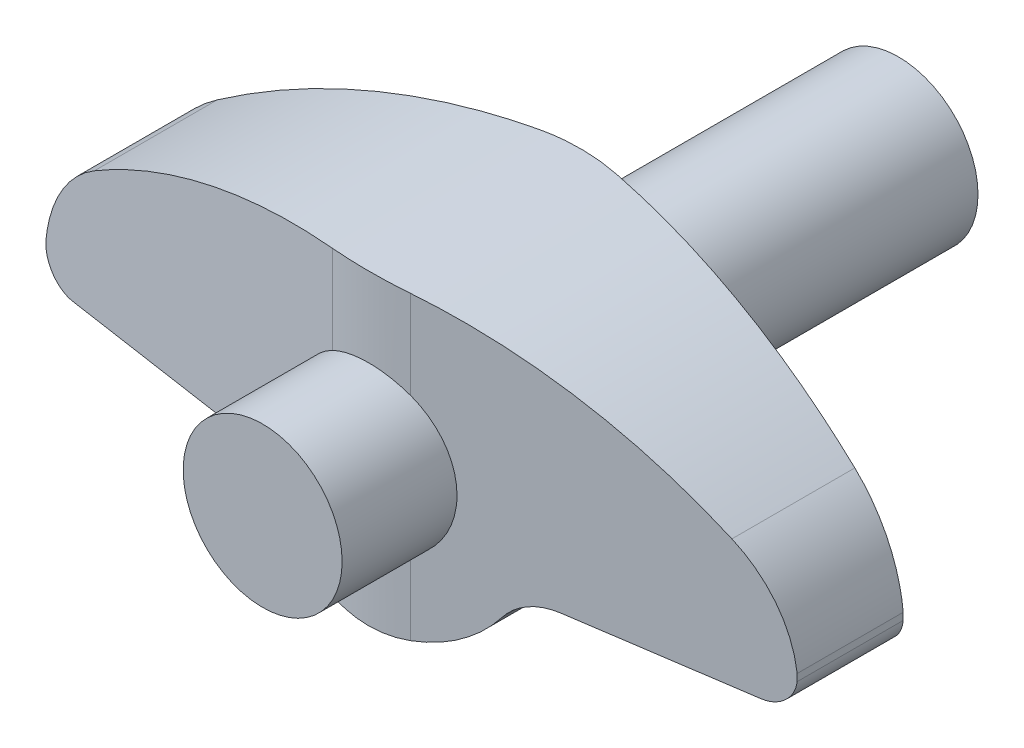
from build123d import *

# Parameters (mm, degrees)
EXTRUDE1_DEPTH          = 12.7
EXTRUDE1_DEPTH_BACK     = 12.7
SKETCH4_OUTSIDE_W       = 47.514
SKETCH4_OUTSIDE_H       = 112.182
CUT_EXTRUDE3_DEPTH      = 38.1
EXTRUDE3_DEPTH          = 25.4
EXTRUDE3_DEPTH_BACK     = 50.8
S2D0006_R               = 9.525
CUT_EXTRUDE5_DEPTH      = 4.445
CUT_EXTRUDE6_DEPTH      = 3.81
CUT_EXTRUDE6_DEPTH_BACK = 3.81


with BuildPart() as part:
    # Sketch1 → Extrude1 (new, two sides: drawn at the far end of the back side and taken through both)
    with BuildSketch(Plane.XY.offset(-EXTRUDE1_DEPTH_BACK)):
        with BuildLine():
            Line((-41.224484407, -7.62), (-20.32, -7.62))
            ThreePointArc((-20.32, -7.62), (-16.912232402, -8.424464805), (-14.224, -10.668))
            ThreePointArc((-14.224, -10.668), (0, -17.78), (14.224, -10.668))
            ThreePointArc((14.224, -10.668), (16.912232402, -8.424464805), (20.32, -7.62))
            Line((20.32, -7.62), (41.224484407, -7.62))
            ThreePointArc((41.224484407, -7.62), (44.064290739, -6.35), (45.010892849, -3.386666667))
            ThreePointArc((45.010892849, -3.386666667), (42.843768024, 2.908485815), (38.199749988, 7.679069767))
            ThreePointArc((38.199749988, 7.679069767), (0, 19.05), (-38.199749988, 7.679069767))
            ThreePointArc((-38.199749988, 7.679069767), (-42.843768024, 2.908485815), (-45.010892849, -3.386666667))
            ThreePointArc((-45.010892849, -3.386666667), (-44.064290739, -6.35), (-41.224484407, -7.62))
        make_face()
    extrude(amount=EXTRUDE1_DEPTH + EXTRUDE1_DEPTH_BACK)

    # Sketch4 outside → Cut-Extrude3 (cut, symmetric)
    with BuildSketch(Plane(origin=(0, 0, 0), x_dir=(0, 0, -1), z_dir=(0, 1, 0))):
        Rectangle(SKETCH4_OUTSIDE_W, SKETCH4_OUTSIDE_H)
        with BuildLine():
            Line((-12.354014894, 4.674435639), (-6.35, 45.010892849))
            Line((-6.35, 45.010892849), (6.35, 45.010892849))
            Line((6.35, 45.010892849), (12.354014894, 4.674435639))
            ThreePointArc((12.354014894, 4.674435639), (12.7, 0), (12.354014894, -4.674435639))
            Line((12.354014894, -4.674435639), (6.35, -45.010892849))
            Line((6.35, -45.010892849), (-6.35, -45.010892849))
            Line((-6.35, -45.010892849), (-12.354014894, -4.674435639))
            ThreePointArc((-12.354014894, -4.674435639), (-12.7, 0), (-12.354014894, 4.674435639))
        make_face(mode=Mode.SUBTRACT)
    extrude(amount=CUT_EXTRUDE3_DEPTH, both=True, mode=Mode.SUBTRACT)

    # S2D0006 → Extrude3 (add, two sides: drawn at the far end of the back side and taken through both)
    with BuildSketch(Plane.XY.offset(-EXTRUDE3_DEPTH_BACK)):
        Circle(S2D0006_R)
    extrude(amount=EXTRUDE3_DEPTH + EXTRUDE3_DEPTH_BACK)

    # Sketch8 → Cut-Extrude5 (cut, symmetric)
    with BuildSketch(Plane(origin=(0, 0, 0), x_dir=(-1, 0, 0), z_dir=(0, 0, -1))):
        with BuildLine():
            Line((-25.4, -7.62), (-38.1, -7.62))
            ThreePointArc((-38.1, -7.62), (-31.75, -1.27), (-25.4, -7.62))
        make_face()
    extrude(amount=CUT_EXTRUDE5_DEPTH, both=True, mode=Mode.SUBTRACT)

    # Sketch7 → Cut-Extrude6 (cut, two sides: drawn at the far end of the back side and taken through both)
    with BuildSketch(Plane.XY.offset(-CUT_EXTRUDE6_DEPTH_BACK)):
        with BuildLine():
            Line((-25.4, -7.62), (-38.1, -7.62))
            ThreePointArc((-38.1, -7.62), (-31.75, -1.27), (-25.4, -7.62))
        make_face()
    extrude(amount=CUT_EXTRUDE6_DEPTH + CUT_EXTRUDE6_DEPTH_BACK, mode=Mode.SUBTRACT)


solid = part.part
